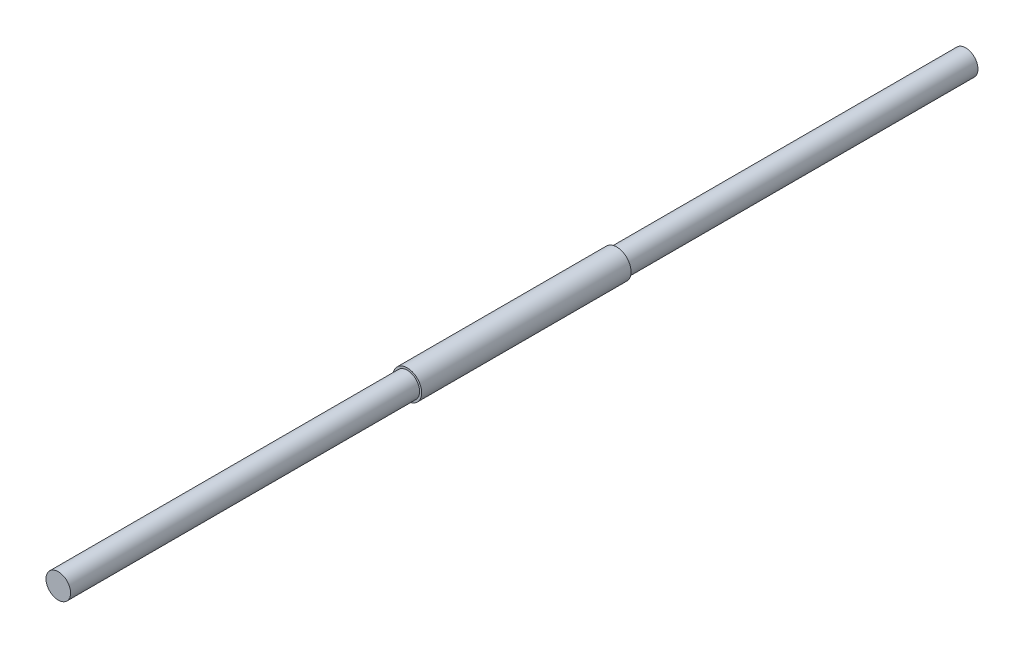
ISO-10303-21;
HEADER;
FILE_DESCRIPTION(('STEP AP214'),'2;1');
FILE_NAME('part.step','',(''),(''),'','','');
FILE_SCHEMA(('AUTOMOTIVE_DESIGN { 1 0 10303 214 1 1 1 1 }'));
ENDSEC;
DATA;
#1=APPLICATION_CONTEXT('core data for automotive mechanical design processes');
#2=APPLICATION_PROTOCOL_DEFINITION('international standard','automotive_design',2000,#1);
#3=PRODUCT_CONTEXT('',#1,'mechanical');
#4=PRODUCT('Part','Part','',(#3));
#5=PRODUCT_RELATED_PRODUCT_CATEGORY('part','',(#4));
#6=PRODUCT_DEFINITION_FORMATION('','',#4);
#7=PRODUCT_DEFINITION_CONTEXT('part definition',#1,'design');
#8=PRODUCT_DEFINITION('design','',#6,#7);
#9=PRODUCT_DEFINITION_SHAPE('','',#8);
#10=(LENGTH_UNIT() NAMED_UNIT(*) SI_UNIT(.MILLI.,.METRE.));
#11=(NAMED_UNIT(*) PLANE_ANGLE_UNIT() SI_UNIT($,.RADIAN.));
#12=(NAMED_UNIT(*) SI_UNIT($,.STERADIAN.) SOLID_ANGLE_UNIT());
#13=UNCERTAINTY_MEASURE_WITH_UNIT(LENGTH_MEASURE(1.E-05),#10,'distance_accuracy_value','');
#14=(GEOMETRIC_REPRESENTATION_CONTEXT(3) GLOBAL_UNCERTAINTY_ASSIGNED_CONTEXT((#13)) GLOBAL_UNIT_ASSIGNED_CONTEXT((#10,
#11,#12)) REPRESENTATION_CONTEXT('',''));
#15=CARTESIAN_POINT('',(0.,0.,0.));
#16=DIRECTION('',(0.,0.,1.));
#17=DIRECTION('',(1.,0.,0.));
#18=AXIS2_PLACEMENT_3D('',#15,#16,#17);
#19=CARTESIAN_POINT('',(0.,0.,25.5));
#20=DIRECTION('',(0.,0.,-1.));
#21=DIRECTION('',(-1.,0.,0.));
#22=AXIS2_PLACEMENT_3D('',#19,#20,#21);
#23=CYLINDRICAL_SURFACE('',#22,3.5);
#24=CARTESIAN_POINT('',(0.,0.,25.5));
#25=DIRECTION('',(0.,0.,1.));
#26=DIRECTION('',(1.,0.,0.));
#27=AXIS2_PLACEMENT_3D('',#24,#25,#26);
#28=CIRCLE('',#27,3.5);
#29=CARTESIAN_POINT('',(3.5,0.,25.5));
#30=VERTEX_POINT('',#29);
#31=EDGE_CURVE('E42',#30,#30,#28,.T.);
#32=ORIENTED_EDGE('',*,*,#31,.F.);
#33=EDGE_LOOP('',(#32));
#34=FACE_BOUND('',#33,.T.);
#35=CARTESIAN_POINT('',(0.,0.,-25.5));
#36=DIRECTION('',(0.,0.,1.));
#37=DIRECTION('',(1.,0.,0.));
#38=AXIS2_PLACEMENT_3D('',#35,#36,#37);
#39=CIRCLE('',#38,3.5);
#40=CARTESIAN_POINT('',(3.5,0.,-25.5));
#41=VERTEX_POINT('',#40);
#42=EDGE_CURVE('E38',#41,#41,#39,.T.);
#43=ORIENTED_EDGE('',*,*,#42,.T.);
#44=EDGE_LOOP('',(#43));
#45=FACE_BOUND('',#44,.T.);
#46=ADVANCED_FACE('F35',(#34,#45),#23,.T.);
#47=CARTESIAN_POINT('',(0.,0.,25.5));
#48=DIRECTION('',(0.,0.,1.));
#49=DIRECTION('',(1.,0.,0.));
#50=AXIS2_PLACEMENT_3D('',#47,#48,#49);
#51=PLANE('',#50);
#52=CARTESIAN_POINT('',(0.,0.,25.5));
#53=DIRECTION('',(0.,0.,1.));
#54=DIRECTION('',(1.,0.,0.));
#55=AXIS2_PLACEMENT_3D('',#52,#53,#54);
#56=CIRCLE('',#55,3.);
#57=CARTESIAN_POINT('',(3.,0.,25.5));
#58=VERTEX_POINT('',#57);
#59=EDGE_CURVE('E10',#58,#58,#56,.T.);
#60=ORIENTED_EDGE('',*,*,#59,.F.);
#61=EDGE_LOOP('',(#60));
#62=FACE_BOUND('',#61,.T.);
#63=ORIENTED_EDGE('',*,*,#31,.T.);
#64=EDGE_LOOP('',(#63));
#65=FACE_BOUND('',#64,.T.);
#66=ADVANCED_FACE('F70',(#62,#65),#51,.T.);
#67=CARTESIAN_POINT('',(0.,0.,-25.5));
#68=DIRECTION('',(0.,0.,1.));
#69=DIRECTION('',(1.,0.,0.));
#70=AXIS2_PLACEMENT_3D('',#67,#68,#69);
#71=PLANE('',#70);
#72=CARTESIAN_POINT('',(0.,0.,-25.5));
#73=DIRECTION('',(0.,0.,1.));
#74=DIRECTION('',(1.,0.,0.));
#75=AXIS2_PLACEMENT_3D('',#72,#73,#74);
#76=CIRCLE('',#75,3.);
#77=CARTESIAN_POINT('',(3.,0.,-25.5));
#78=VERTEX_POINT('',#77);
#79=EDGE_CURVE('E52',#78,#78,#76,.T.);
#80=ORIENTED_EDGE('',*,*,#79,.T.);
#81=EDGE_LOOP('',(#80));
#82=FACE_BOUND('',#81,.T.);
#83=ORIENTED_EDGE('',*,*,#42,.F.);
#84=EDGE_LOOP('',(#83));
#85=FACE_BOUND('',#84,.T.);
#86=ADVANCED_FACE('F75',(#82,#85),#71,.F.);
#87=CARTESIAN_POINT('',(0.,0.,110.5));
#88=DIRECTION('',(0.,0.,-1.));
#89=DIRECTION('',(-1.,0.,0.));
#90=AXIS2_PLACEMENT_3D('',#87,#88,#89);
#91=CYLINDRICAL_SURFACE('',#90,3.);
#92=CARTESIAN_POINT('',(0.,0.,110.5));
#93=DIRECTION('',(0.,0.,1.));
#94=DIRECTION('',(1.,0.,0.));
#95=AXIS2_PLACEMENT_3D('',#92,#93,#94);
#96=CIRCLE('',#95,3.);
#97=CARTESIAN_POINT('',(3.,0.,110.5));
#98=VERTEX_POINT('',#97);
#99=EDGE_CURVE('E48',#98,#98,#96,.T.);
#100=ORIENTED_EDGE('',*,*,#99,.F.);
#101=EDGE_LOOP('',(#100));
#102=FACE_BOUND('',#101,.T.);
#103=ORIENTED_EDGE('',*,*,#59,.T.);
#104=EDGE_LOOP('',(#103));
#105=FACE_BOUND('',#104,.T.);
#106=ADVANCED_FACE('F84',(#102,#105),#91,.T.);
#107=CARTESIAN_POINT('',(0.,0.,110.5));
#108=DIRECTION('',(0.,0.,1.));
#109=DIRECTION('',(1.,0.,0.));
#110=AXIS2_PLACEMENT_3D('',#107,#108,#109);
#111=PLANE('',#110);
#112=ORIENTED_EDGE('',*,*,#99,.T.);
#113=EDGE_LOOP('',(#112));
#114=FACE_BOUND('',#113,.T.);
#115=ADVANCED_FACE('F67',(#114),#111,.T.);
#116=CARTESIAN_POINT('',(0.,0.,-110.5));
#117=DIRECTION('',(0.,0.,1.));
#118=DIRECTION('',(1.,0.,0.));
#119=AXIS2_PLACEMENT_3D('',#116,#117,#118);
#120=CYLINDRICAL_SURFACE('',#119,3.);
#121=CARTESIAN_POINT('',(0.,0.,-110.5));
#122=DIRECTION('',(0.,0.,1.));
#123=DIRECTION('',(1.,0.,0.));
#124=AXIS2_PLACEMENT_3D('',#121,#122,#123);
#125=CIRCLE('',#124,3.);
#126=CARTESIAN_POINT('',(3.,0.,-110.5));
#127=VERTEX_POINT('',#126);
#128=EDGE_CURVE('E51',#127,#127,#125,.T.);
#129=ORIENTED_EDGE('',*,*,#128,.T.);
#130=EDGE_LOOP('',(#129));
#131=FACE_BOUND('',#130,.T.);
#132=ORIENTED_EDGE('',*,*,#79,.F.);
#133=EDGE_LOOP('',(#132));
#134=FACE_BOUND('',#133,.T.);
#135=ADVANCED_FACE('F58',(#131,#134),#120,.T.);
#136=CARTESIAN_POINT('',(0.,0.,-110.5));
#137=DIRECTION('',(0.,0.,-1.));
#138=DIRECTION('',(1.,0.,0.));
#139=AXIS2_PLACEMENT_3D('',#136,#137,#138);
#140=PLANE('',#139);
#141=ORIENTED_EDGE('',*,*,#128,.F.);
#142=EDGE_LOOP('',(#141));
#143=FACE_BOUND('',#142,.T.);
#144=ADVANCED_FACE('F61',(#143),#140,.T.);
#145=CLOSED_SHELL('',(#46,#66,#86,#106,#115,#135,#144));
#146=MANIFOLD_SOLID_BREP('B2',#145);
#147=ADVANCED_BREP_SHAPE_REPRESENTATION('',(#18,#146),#14);
#148=SHAPE_DEFINITION_REPRESENTATION(#9,#147);
ENDSEC;
END-ISO-10303-21;
